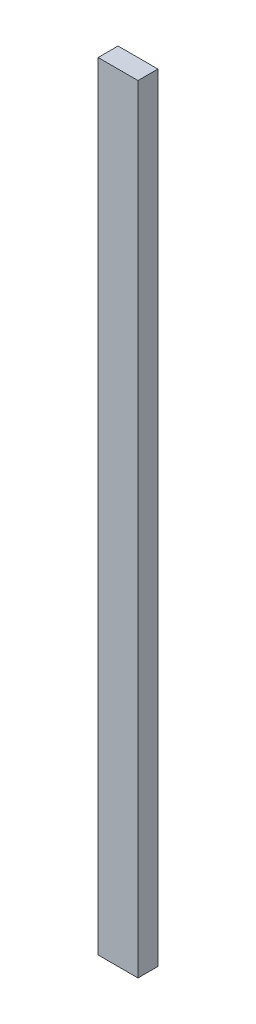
ISO-10303-21;
HEADER;
FILE_DESCRIPTION(('STEP AP214'),'2;1');
FILE_NAME('part.step','',(''),(''),'','','');
FILE_SCHEMA(('AUTOMOTIVE_DESIGN { 1 0 10303 214 1 1 1 1 }'));
ENDSEC;
DATA;
#1=APPLICATION_CONTEXT('core data for automotive mechanical design processes');
#2=APPLICATION_PROTOCOL_DEFINITION('international standard','automotive_design',2000,#1);
#3=PRODUCT_CONTEXT('',#1,'mechanical');
#4=PRODUCT('Part','Part','',(#3));
#5=PRODUCT_RELATED_PRODUCT_CATEGORY('part','',(#4));
#6=PRODUCT_DEFINITION_FORMATION('','',#4);
#7=PRODUCT_DEFINITION_CONTEXT('part definition',#1,'design');
#8=PRODUCT_DEFINITION('design','',#6,#7);
#9=PRODUCT_DEFINITION_SHAPE('','',#8);
#10=(LENGTH_UNIT() NAMED_UNIT(*) SI_UNIT(.MILLI.,.METRE.));
#11=(NAMED_UNIT(*) PLANE_ANGLE_UNIT() SI_UNIT($,.RADIAN.));
#12=(NAMED_UNIT(*) SI_UNIT($,.STERADIAN.) SOLID_ANGLE_UNIT());
#13=UNCERTAINTY_MEASURE_WITH_UNIT(LENGTH_MEASURE(1.E-05),#10,'distance_accuracy_value','');
#14=(GEOMETRIC_REPRESENTATION_CONTEXT(3) GLOBAL_UNCERTAINTY_ASSIGNED_CONTEXT((#13)) GLOBAL_UNIT_ASSIGNED_CONTEXT((#10,
#11,#12)) REPRESENTATION_CONTEXT('',''));
#15=CARTESIAN_POINT('',(0.,0.,0.));
#16=DIRECTION('',(0.,0.,1.));
#17=DIRECTION('',(1.,0.,0.));
#18=AXIS2_PLACEMENT_3D('',#15,#16,#17);
#19=CARTESIAN_POINT('',(50.8,1981.2,-25.4));
#20=DIRECTION('',(-1.,0.,0.));
#21=DIRECTION('',(0.,0.,1.));
#22=AXIS2_PLACEMENT_3D('',#19,#20,#21);
#23=PLANE('',#22);
#24=DIRECTION('',(0.,0.,-1.));
#25=VECTOR('',#24,1.);
#26=CARTESIAN_POINT('',(50.8,0.,-25.4));
#27=LINE('',#26,#25);
#28=CARTESIAN_POINT('',(50.8,0.,25.4));
#29=VERTEX_POINT('',#28);
#30=CARTESIAN_POINT('',(50.8,0.,-25.4));
#31=VERTEX_POINT('',#30);
#32=EDGE_CURVE('E96',#29,#31,#27,.T.);
#33=ORIENTED_EDGE('',*,*,#32,.T.);
#34=DIRECTION('',(0.,-1.,0.));
#35=VECTOR('',#34,1.);
#36=CARTESIAN_POINT('',(50.8,1981.2,-25.4));
#37=LINE('',#36,#35);
#38=CARTESIAN_POINT('',(50.8,1981.2,-25.4));
#39=VERTEX_POINT('',#38);
#40=EDGE_CURVE('E11',#39,#31,#37,.T.);
#41=ORIENTED_EDGE('',*,*,#40,.F.);
#42=DIRECTION('',(0.,0.,-1.));
#43=VECTOR('',#42,1.);
#44=CARTESIAN_POINT('',(50.8,1981.2,-25.4));
#45=LINE('',#44,#43);
#46=CARTESIAN_POINT('',(50.8,1981.2,25.4));
#47=VERTEX_POINT('',#46);
#48=EDGE_CURVE('E84',#47,#39,#45,.T.);
#49=ORIENTED_EDGE('',*,*,#48,.F.);
#50=DIRECTION('',(0.,-1.,0.));
#51=VECTOR('',#50,1.);
#52=CARTESIAN_POINT('',(50.8,1981.2,25.4));
#53=LINE('',#52,#51);
#54=EDGE_CURVE('E92',#47,#29,#53,.T.);
#55=ORIENTED_EDGE('',*,*,#54,.T.);
#56=EDGE_LOOP('',(#33,#41,#49,#55));
#57=FACE_BOUND('',#56,.T.);
#58=ADVANCED_FACE('F33',(#57),#23,.F.);
#59=CARTESIAN_POINT('',(-50.8,1981.2,-25.4));
#60=DIRECTION('',(0.,0.,1.));
#61=DIRECTION('',(1.,0.,0.));
#62=AXIS2_PLACEMENT_3D('',#59,#60,#61);
#63=PLANE('',#62);
#64=DIRECTION('',(-1.,0.,0.));
#65=VECTOR('',#64,1.);
#66=CARTESIAN_POINT('',(-50.8,0.,-25.4));
#67=LINE('',#66,#65);
#68=CARTESIAN_POINT('',(-50.8,0.,-25.4));
#69=VERTEX_POINT('',#68);
#70=EDGE_CURVE('E88',#31,#69,#67,.T.);
#71=ORIENTED_EDGE('',*,*,#70,.T.);
#72=DIRECTION('',(0.,-1.,0.));
#73=VECTOR('',#72,1.);
#74=CARTESIAN_POINT('',(-50.8,1981.2,-25.4));
#75=LINE('',#74,#73);
#76=CARTESIAN_POINT('',(-50.8,1981.2,-25.4));
#77=VERTEX_POINT('',#76);
#78=EDGE_CURVE('E41',#77,#69,#75,.T.);
#79=ORIENTED_EDGE('',*,*,#78,.F.);
#80=DIRECTION('',(-1.,0.,0.));
#81=VECTOR('',#80,1.);
#82=CARTESIAN_POINT('',(-50.8,1981.2,-25.4));
#83=LINE('',#82,#81);
#84=EDGE_CURVE('E79',#39,#77,#83,.T.);
#85=ORIENTED_EDGE('',*,*,#84,.F.);
#86=ORIENTED_EDGE('',*,*,#40,.T.);
#87=EDGE_LOOP('',(#71,#79,#85,#86));
#88=FACE_BOUND('',#87,.T.);
#89=ADVANCED_FACE('F87',(#88),#63,.F.);
#90=CARTESIAN_POINT('',(-50.8,1981.2,-25.4));
#91=DIRECTION('',(1.,0.,0.));
#92=DIRECTION('',(0.,0.,-1.));
#93=AXIS2_PLACEMENT_3D('',#90,#91,#92);
#94=PLANE('',#93);
#95=DIRECTION('',(0.,0.,1.));
#96=VECTOR('',#95,1.);
#97=CARTESIAN_POINT('',(-50.8,0.,-25.4));
#98=LINE('',#97,#96);
#99=CARTESIAN_POINT('',(-50.8,0.,25.4));
#100=VERTEX_POINT('',#99);
#101=EDGE_CURVE('E66',#69,#100,#98,.T.);
#102=ORIENTED_EDGE('',*,*,#101,.T.);
#103=DIRECTION('',(0.,-1.,0.));
#104=VECTOR('',#103,1.);
#105=CARTESIAN_POINT('',(-50.8,1981.2,25.4));
#106=LINE('',#105,#104);
#107=CARTESIAN_POINT('',(-50.8,1981.2,25.4));
#108=VERTEX_POINT('',#107);
#109=EDGE_CURVE('E89',#108,#100,#106,.T.);
#110=ORIENTED_EDGE('',*,*,#109,.F.);
#111=DIRECTION('',(0.,0.,1.));
#112=VECTOR('',#111,1.);
#113=CARTESIAN_POINT('',(-50.8,1981.2,-25.4));
#114=LINE('',#113,#112);
#115=EDGE_CURVE('E82',#77,#108,#114,.T.);
#116=ORIENTED_EDGE('',*,*,#115,.F.);
#117=ORIENTED_EDGE('',*,*,#78,.T.);
#118=EDGE_LOOP('',(#102,#110,#116,#117));
#119=FACE_BOUND('',#118,.T.);
#120=ADVANCED_FACE('F90',(#119),#94,.F.);
#121=CARTESIAN_POINT('',(-50.8,1981.2,25.4));
#122=DIRECTION('',(0.,0.,-1.));
#123=DIRECTION('',(-1.,0.,0.));
#124=AXIS2_PLACEMENT_3D('',#121,#122,#123);
#125=PLANE('',#124);
#126=DIRECTION('',(1.,0.,0.));
#127=VECTOR('',#126,1.);
#128=CARTESIAN_POINT('',(-50.8,0.,25.4));
#129=LINE('',#128,#127);
#130=EDGE_CURVE('E72',#100,#29,#129,.T.);
#131=ORIENTED_EDGE('',*,*,#130,.T.);
#132=ORIENTED_EDGE('',*,*,#54,.F.);
#133=DIRECTION('',(1.,0.,0.));
#134=VECTOR('',#133,1.);
#135=CARTESIAN_POINT('',(-50.8,1981.2,25.4));
#136=LINE('',#135,#134);
#137=EDGE_CURVE('E49',#108,#47,#136,.T.);
#138=ORIENTED_EDGE('',*,*,#137,.F.);
#139=ORIENTED_EDGE('',*,*,#109,.T.);
#140=EDGE_LOOP('',(#131,#132,#138,#139));
#141=FACE_BOUND('',#140,.T.);
#142=ADVANCED_FACE('F103',(#141),#125,.F.);
#143=CARTESIAN_POINT('',(0.,1981.2,0.));
#144=DIRECTION('',(0.,1.,0.));
#145=DIRECTION('',(0.,0.,1.));
#146=AXIS2_PLACEMENT_3D('',#143,#144,#145);
#147=PLANE('',#146);
#148=ORIENTED_EDGE('',*,*,#48,.T.);
#149=ORIENTED_EDGE('',*,*,#84,.T.);
#150=ORIENTED_EDGE('',*,*,#115,.T.);
#151=ORIENTED_EDGE('',*,*,#137,.T.);
#152=EDGE_LOOP('',(#148,#149,#150,#151));
#153=FACE_BOUND('',#152,.T.);
#154=ADVANCED_FACE('F80',(#153),#147,.T.);
#155=CARTESIAN_POINT('',(0.,0.,0.));
#156=DIRECTION('',(0.,1.,0.));
#157=DIRECTION('',(0.,0.,1.));
#158=AXIS2_PLACEMENT_3D('',#155,#156,#157);
#159=PLANE('',#158);
#160=ORIENTED_EDGE('',*,*,#32,.F.);
#161=ORIENTED_EDGE('',*,*,#130,.F.);
#162=ORIENTED_EDGE('',*,*,#101,.F.);
#163=ORIENTED_EDGE('',*,*,#70,.F.);
#164=EDGE_LOOP('',(#160,#161,#162,#163));
#165=FACE_BOUND('',#164,.T.);
#166=ADVANCED_FACE('F106',(#165),#159,.F.);
#167=CLOSED_SHELL('',(#58,#89,#120,#142,#154,#166));
#168=MANIFOLD_SOLID_BREP('B2',#167);
#169=ADVANCED_BREP_SHAPE_REPRESENTATION('',(#18,#168),#14);
#170=SHAPE_DEFINITION_REPRESENTATION(#9,#169);
ENDSEC;
END-ISO-10303-21;
